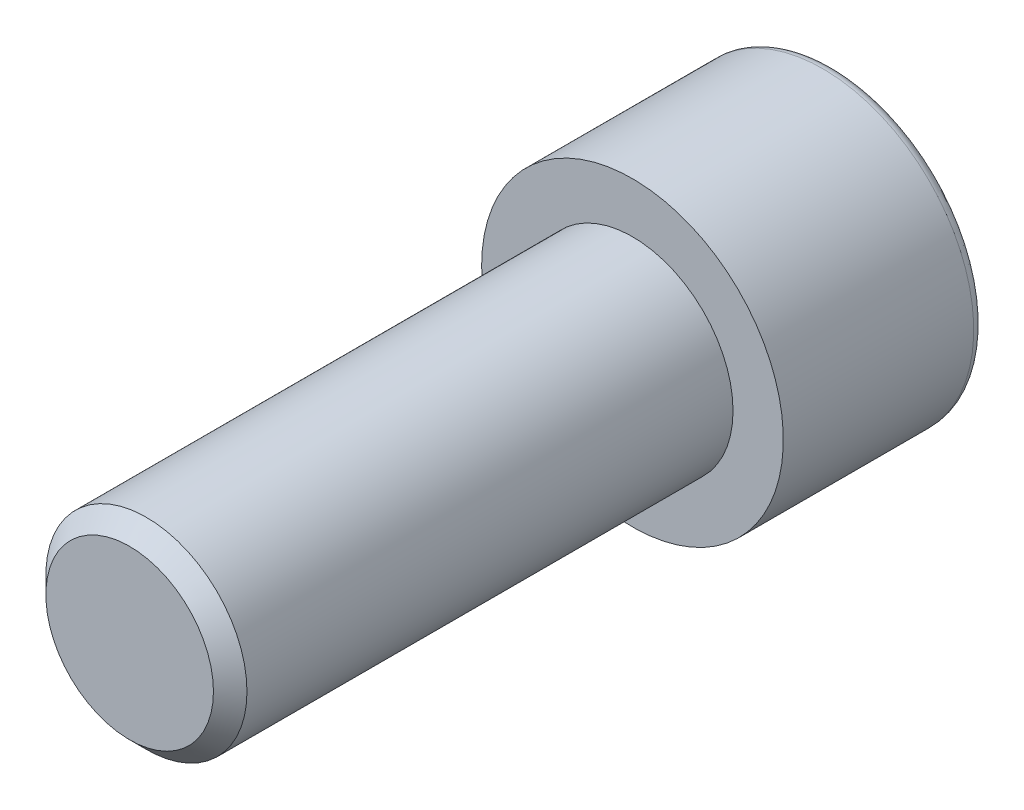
from build123d import *

# Parameters (mm, degrees)
ENLEV_MAT_EXTRU1_DEPTH = 6
ESQUISSE3_W            = 6
ESQUISSE3_H            = 30
CHANFREIN1_SIZE        = 1


with BuildPart() as part:
    # Esquisse1 → Base-R_volution (revolve)
    with BuildSketch(Plane(origin=(0, 0, 0), x_dir=(1, 0, 0), z_dir=(0, 1, 0)), mode=Mode.PRIVATE) as base_r_volution_sk:
        with BuildLine():
            Line((0, 0), (9, 0))
            Line((9, 0), (9, 11.36))
            ThreePointArc((9, 11.36), (8.81254834, 11.81254834), (8.36, 12))
            Line((8.36, 12), (0, 12))
            Line((0, 12), (0, 0))
        make_face()
    revolve(base_r_volution_sk.sketch.rotate(Axis((0, 0, 0), (0, 0, -1)), 180), axis=Axis((0, 0, 0), (0, 0, -1)))

    # Esquisse2 → enlev-mat-Extru1 (cut)
    with BuildSketch(Plane.XY.offset(-12)):
        Polygon((5, -2.886751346), (5, 2.886751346), (0, 5.773502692), (-5, 2.886751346), (-5, -2.886751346), (0, -5.773502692), align=None)
    extrude(amount=ENLEV_MAT_EXTRU1_DEPTH, mode=Mode.SUBTRACT)

    # Esquisse3 → Boss.-R_vol.1 (revolve)
    with BuildSketch(Plane(origin=(0, 0, 0), x_dir=(1, 0, 0), z_dir=(0, 1, 0))):
        with Locations((3, -15)):
            Rectangle(ESQUISSE3_W, ESQUISSE3_H)
    revolve(axis=Axis((0, 0, 0), (0, 0, 1)))

    # Chanfrein1
    chanfrein1_edges = [part.edges().sort_by_distance(p)[0] for p in [
        (-6, 0, 30),
    ]]
    chamfer(chanfrein1_edges, length=CHANFREIN1_SIZE)


solid = part.part
